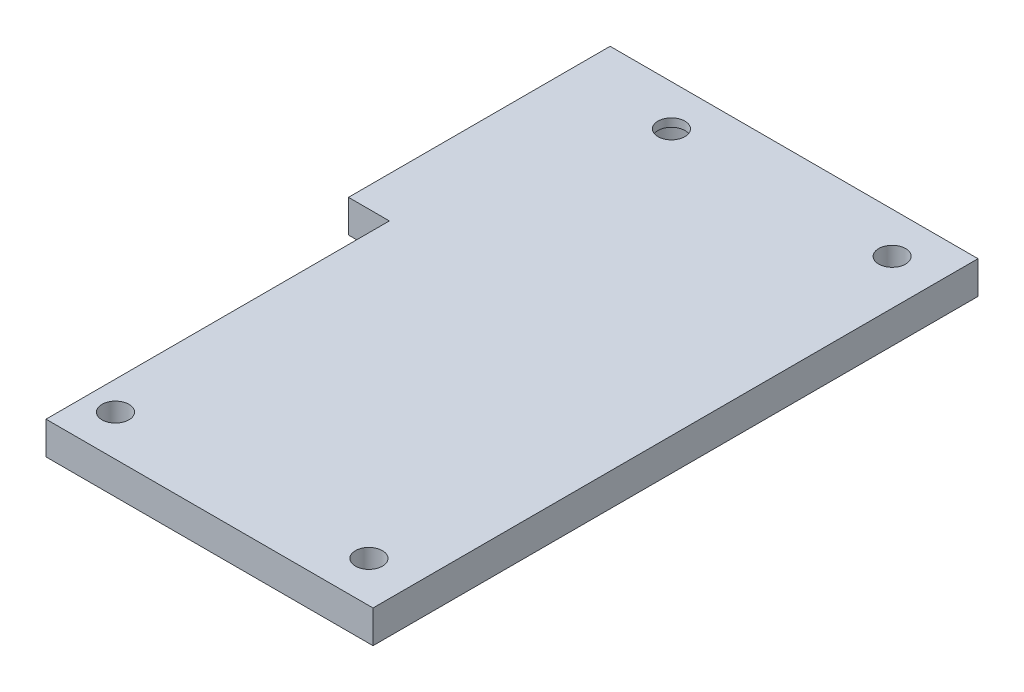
ISO-10303-21;
HEADER;
FILE_DESCRIPTION(('STEP AP214'),'2;1');
FILE_NAME('part.step','',(''),(''),'','','');
FILE_SCHEMA(('AUTOMOTIVE_DESIGN { 1 0 10303 214 1 1 1 1 }'));
ENDSEC;
DATA;
#1=APPLICATION_CONTEXT('core data for automotive mechanical design processes');
#2=APPLICATION_PROTOCOL_DEFINITION('international standard','automotive_design',2000,#1);
#3=PRODUCT_CONTEXT('',#1,'mechanical');
#4=PRODUCT('Part','Part','',(#3));
#5=PRODUCT_RELATED_PRODUCT_CATEGORY('part','',(#4));
#6=PRODUCT_DEFINITION_FORMATION('','',#4);
#7=PRODUCT_DEFINITION_CONTEXT('part definition',#1,'design');
#8=PRODUCT_DEFINITION('design','',#6,#7);
#9=PRODUCT_DEFINITION_SHAPE('','',#8);
#10=(LENGTH_UNIT() NAMED_UNIT(*) SI_UNIT(.MILLI.,.METRE.));
#11=(NAMED_UNIT(*) PLANE_ANGLE_UNIT() SI_UNIT($,.RADIAN.));
#12=(NAMED_UNIT(*) SI_UNIT($,.STERADIAN.) SOLID_ANGLE_UNIT());
#13=UNCERTAINTY_MEASURE_WITH_UNIT(LENGTH_MEASURE(1.E-05),#10,'distance_accuracy_value','');
#14=(GEOMETRIC_REPRESENTATION_CONTEXT(3) GLOBAL_UNCERTAINTY_ASSIGNED_CONTEXT((#13)) GLOBAL_UNIT_ASSIGNED_CONTEXT((#10,
#11,#12)) REPRESENTATION_CONTEXT('',''));
#15=CARTESIAN_POINT('',(0.,0.,0.));
#16=DIRECTION('',(0.,0.,1.));
#17=DIRECTION('',(1.,0.,0.));
#18=AXIS2_PLACEMENT_3D('',#15,#16,#17);
#19=CARTESIAN_POINT('',(-10.,4.,-32.));
#20=DIRECTION('',(0.,-1.,0.));
#21=DIRECTION('',(0.,0.,-1.));
#22=AXIS2_PLACEMENT_3D('',#19,#20,#21);
#23=CYLINDRICAL_SURFACE('',#22,1.65);
#24=CARTESIAN_POINT('',(-10.,4.,-32.));
#25=DIRECTION('',(0.,1.,0.));
#26=DIRECTION('',(0.,0.,1.));
#27=AXIS2_PLACEMENT_3D('',#24,#25,#26);
#28=CIRCLE('',#27,1.65);
#29=CARTESIAN_POINT('',(-10.,4.,-30.35));
#30=VERTEX_POINT('',#29);
#31=EDGE_CURVE('E123',#30,#30,#28,.T.);
#32=ORIENTED_EDGE('',*,*,#31,.T.);
#33=EDGE_LOOP('',(#32));
#34=FACE_BOUND('',#33,.T.);
#35=CARTESIAN_POINT('',(-10.,3.,-32.));
#36=DIRECTION('',(0.,-1.,0.));
#37=DIRECTION('',(0.,0.,-1.));
#38=AXIS2_PLACEMENT_3D('',#35,#36,#37);
#39=CIRCLE('',#38,1.65);
#40=CARTESIAN_POINT('',(-10.,3.,-33.65));
#41=VERTEX_POINT('',#40);
#42=EDGE_CURVE('E39',#41,#41,#39,.T.);
#43=ORIENTED_EDGE('',*,*,#42,.T.);
#44=EDGE_LOOP('',(#43));
#45=FACE_BOUND('',#44,.T.);
#46=ADVANCED_FACE('F35',(#34,#45),#23,.F.);
#47=CARTESIAN_POINT('',(0.,4.,0.));
#48=DIRECTION('',(0.,1.,0.));
#49=DIRECTION('',(0.,0.,1.));
#50=AXIS2_PLACEMENT_3D('',#47,#48,#49);
#51=PLANE('',#50);
#52=DIRECTION('',(0.,0.,1.));
#53=VECTOR('',#52,1.);
#54=CARTESIAN_POINT('',(-17.5,4.,37.));
#55=LINE('',#54,#53);
#56=CARTESIAN_POINT('',(-17.5,4.,-4.99999999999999));
#57=VERTEX_POINT('',#56);
#58=CARTESIAN_POINT('',(-17.5,4.,37.));
#59=VERTEX_POINT('',#58);
#60=EDGE_CURVE('E106',#57,#59,#55,.T.);
#61=ORIENTED_EDGE('',*,*,#60,.T.);
#62=DIRECTION('',(1.,0.,0.));
#63=VECTOR('',#62,1.);
#64=CARTESIAN_POINT('',(22.5,4.,37.));
#65=LINE('',#64,#63);
#66=CARTESIAN_POINT('',(22.5,4.,37.));
#67=VERTEX_POINT('',#66);
#68=EDGE_CURVE('E82',#59,#67,#65,.T.);
#69=ORIENTED_EDGE('',*,*,#68,.T.);
#70=DIRECTION('',(0.,0.,-1.));
#71=VECTOR('',#70,1.);
#72=CARTESIAN_POINT('',(22.5,4.,37.));
#73=LINE('',#72,#71);
#74=CARTESIAN_POINT('',(22.5,4.,-37.));
#75=VERTEX_POINT('',#74);
#76=EDGE_CURVE('E118',#67,#75,#73,.T.);
#77=ORIENTED_EDGE('',*,*,#76,.T.);
#78=DIRECTION('',(-1.,0.,0.));
#79=VECTOR('',#78,1.);
#80=CARTESIAN_POINT('',(22.5,4.,-37.));
#81=LINE('',#80,#79);
#82=CARTESIAN_POINT('',(-22.5,4.,-37.));
#83=VERTEX_POINT('',#82);
#84=EDGE_CURVE('E60',#75,#83,#81,.T.);
#85=ORIENTED_EDGE('',*,*,#84,.T.);
#86=DIRECTION('',(0.,0.,1.));
#87=VECTOR('',#86,1.);
#88=CARTESIAN_POINT('',(-22.5,4.,37.));
#89=LINE('',#88,#87);
#90=CARTESIAN_POINT('',(-22.5,4.,-4.99999999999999));
#91=VERTEX_POINT('',#90);
#92=EDGE_CURVE('E111',#83,#91,#89,.T.);
#93=ORIENTED_EDGE('',*,*,#92,.T.);
#94=DIRECTION('',(1.,0.,0.));
#95=VECTOR('',#94,1.);
#96=CARTESIAN_POINT('',(-17.5,4.,-4.99999999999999));
#97=LINE('',#96,#95);
#98=EDGE_CURVE('E98',#91,#57,#97,.T.);
#99=ORIENTED_EDGE('',*,*,#98,.T.);
#100=EDGE_LOOP('',(#61,#69,#77,#85,#93,#99));
#101=FACE_BOUND('',#100,.T.);
#102=CARTESIAN_POINT('',(-14.,4.,32.));
#103=DIRECTION('',(0.,1.,0.));
#104=DIRECTION('',(0.,0.,1.));
#105=AXIS2_PLACEMENT_3D('',#102,#103,#104);
#106=CIRCLE('',#105,1.65);
#107=CARTESIAN_POINT('',(-14.,4.,33.65));
#108=VERTEX_POINT('',#107);
#109=EDGE_CURVE('E164',#108,#108,#106,.T.);
#110=ORIENTED_EDGE('',*,*,#109,.F.);
#111=EDGE_LOOP('',(#110));
#112=FACE_BOUND('',#111,.T.);
#113=ORIENTED_EDGE('',*,*,#31,.F.);
#114=EDGE_LOOP('',(#113));
#115=FACE_BOUND('',#114,.T.);
#116=CARTESIAN_POINT('',(17.,4.,-32.));
#117=DIRECTION('',(0.,1.,0.));
#118=DIRECTION('',(0.,0.,1.));
#119=AXIS2_PLACEMENT_3D('',#116,#117,#118);
#120=CIRCLE('',#119,1.65);
#121=CARTESIAN_POINT('',(17.,4.,-30.35));
#122=VERTEX_POINT('',#121);
#123=EDGE_CURVE('E170',#122,#122,#120,.T.);
#124=ORIENTED_EDGE('',*,*,#123,.F.);
#125=EDGE_LOOP('',(#124));
#126=FACE_BOUND('',#125,.T.);
#127=CARTESIAN_POINT('',(17.,4.,32.));
#128=DIRECTION('',(0.,1.,0.));
#129=DIRECTION('',(0.,0.,1.));
#130=AXIS2_PLACEMENT_3D('',#127,#128,#129);
#131=CIRCLE('',#130,1.65);
#132=CARTESIAN_POINT('',(17.,4.,33.65));
#133=VERTEX_POINT('',#132);
#134=EDGE_CURVE('E157',#133,#133,#131,.T.);
#135=ORIENTED_EDGE('',*,*,#134,.F.);
#136=EDGE_LOOP('',(#135));
#137=FACE_BOUND('',#136,.T.);
#138=ADVANCED_FACE('F115',(#101,#112,#115,#126,#137),#51,.T.);
#139=CARTESIAN_POINT('',(0.,0.,0.));
#140=DIRECTION('',(0.,1.,0.));
#141=DIRECTION('',(0.,0.,1.));
#142=AXIS2_PLACEMENT_3D('',#139,#140,#141);
#143=PLANE('',#142);
#144=CARTESIAN_POINT('',(-10.,0.,-32.));
#145=DIRECTION('',(0.,-1.,0.));
#146=DIRECTION('',(0.,0.,-1.));
#147=AXIS2_PLACEMENT_3D('',#144,#145,#146);
#148=CIRCLE('',#147,3.75);
#149=CARTESIAN_POINT('',(-10.,0.,-35.75));
#150=VERTEX_POINT('',#149);
#151=EDGE_CURVE('E150',#150,#150,#148,.T.);
#152=ORIENTED_EDGE('',*,*,#151,.F.);
#153=EDGE_LOOP('',(#152));
#154=FACE_BOUND('',#153,.T.);
#155=DIRECTION('',(1.,0.,0.));
#156=VECTOR('',#155,1.);
#157=CARTESIAN_POINT('',(22.5,0.,37.));
#158=LINE('',#157,#156);
#159=CARTESIAN_POINT('',(-17.5,0.,37.));
#160=VERTEX_POINT('',#159);
#161=CARTESIAN_POINT('',(22.5,0.,37.));
#162=VERTEX_POINT('',#161);
#163=EDGE_CURVE('E130',#160,#162,#158,.T.);
#164=ORIENTED_EDGE('',*,*,#163,.F.);
#165=DIRECTION('',(0.,0.,1.));
#166=VECTOR('',#165,1.);
#167=CARTESIAN_POINT('',(-17.5,0.,37.));
#168=LINE('',#167,#166);
#169=CARTESIAN_POINT('',(-17.5,0.,-4.99999999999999));
#170=VERTEX_POINT('',#169);
#171=EDGE_CURVE('E51',#170,#160,#168,.T.);
#172=ORIENTED_EDGE('',*,*,#171,.F.);
#173=DIRECTION('',(1.,0.,0.));
#174=VECTOR('',#173,1.);
#175=CARTESIAN_POINT('',(-17.5,0.,-4.99999999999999));
#176=LINE('',#175,#174);
#177=CARTESIAN_POINT('',(-22.5,0.,-4.99999999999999));
#178=VERTEX_POINT('',#177);
#179=EDGE_CURVE('E143',#178,#170,#176,.T.);
#180=ORIENTED_EDGE('',*,*,#179,.F.);
#181=DIRECTION('',(0.,0.,1.));
#182=VECTOR('',#181,1.);
#183=CARTESIAN_POINT('',(-22.5,0.,37.));
#184=LINE('',#183,#182);
#185=CARTESIAN_POINT('',(-22.5,0.,-37.));
#186=VERTEX_POINT('',#185);
#187=EDGE_CURVE('E113',#186,#178,#184,.T.);
#188=ORIENTED_EDGE('',*,*,#187,.F.);
#189=DIRECTION('',(-1.,0.,0.));
#190=VECTOR('',#189,1.);
#191=CARTESIAN_POINT('',(22.5,0.,-37.));
#192=LINE('',#191,#190);
#193=CARTESIAN_POINT('',(22.5,0.,-37.));
#194=VERTEX_POINT('',#193);
#195=EDGE_CURVE('E77',#194,#186,#192,.T.);
#196=ORIENTED_EDGE('',*,*,#195,.F.);
#197=DIRECTION('',(0.,0.,-1.));
#198=VECTOR('',#197,1.);
#199=CARTESIAN_POINT('',(22.5,0.,37.));
#200=LINE('',#199,#198);
#201=EDGE_CURVE('E120',#162,#194,#200,.T.);
#202=ORIENTED_EDGE('',*,*,#201,.F.);
#203=EDGE_LOOP('',(#164,#172,#180,#188,#196,#202));
#204=FACE_BOUND('',#203,.T.);
#205=CARTESIAN_POINT('',(17.,0.,-32.));
#206=DIRECTION('',(0.,1.,0.));
#207=DIRECTION('',(0.,0.,1.));
#208=AXIS2_PLACEMENT_3D('',#205,#206,#207);
#209=CIRCLE('',#208,1.65);
#210=CARTESIAN_POINT('',(17.,0.,-30.35));
#211=VERTEX_POINT('',#210);
#212=EDGE_CURVE('E167',#211,#211,#209,.T.);
#213=ORIENTED_EDGE('',*,*,#212,.T.);
#214=EDGE_LOOP('',(#213));
#215=FACE_BOUND('',#214,.T.);
#216=CARTESIAN_POINT('',(-14.,0.,32.));
#217=DIRECTION('',(0.,1.,0.));
#218=DIRECTION('',(0.,0.,1.));
#219=AXIS2_PLACEMENT_3D('',#216,#217,#218);
#220=CIRCLE('',#219,1.65);
#221=CARTESIAN_POINT('',(-14.,0.,33.65));
#222=VERTEX_POINT('',#221);
#223=EDGE_CURVE('E160',#222,#222,#220,.T.);
#224=ORIENTED_EDGE('',*,*,#223,.T.);
#225=EDGE_LOOP('',(#224));
#226=FACE_BOUND('',#225,.T.);
#227=CARTESIAN_POINT('',(17.,0.,32.));
#228=DIRECTION('',(0.,1.,0.));
#229=DIRECTION('',(0.,0.,1.));
#230=AXIS2_PLACEMENT_3D('',#227,#228,#229);
#231=CIRCLE('',#230,1.65);
#232=CARTESIAN_POINT('',(17.,0.,33.65));
#233=VERTEX_POINT('',#232);
#234=EDGE_CURVE('E161',#233,#233,#231,.T.);
#235=ORIENTED_EDGE('',*,*,#234,.T.);
#236=EDGE_LOOP('',(#235));
#237=FACE_BOUND('',#236,.T.);
#238=ADVANCED_FACE('F141',(#154,#204,#215,#226,#237),#143,.F.);
#239=CARTESIAN_POINT('',(-22.5,4.,37.));
#240=DIRECTION('',(1.,0.,0.));
#241=DIRECTION('',(0.,0.,-1.));
#242=AXIS2_PLACEMENT_3D('',#239,#240,#241);
#243=PLANE('',#242);
#244=ORIENTED_EDGE('',*,*,#187,.T.);
#245=DIRECTION('',(0.,-1.,0.));
#246=VECTOR('',#245,1.);
#247=CARTESIAN_POINT('',(-22.5,4.,-4.99999999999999));
#248=LINE('',#247,#246);
#249=EDGE_CURVE('E102',#91,#178,#248,.T.);
#250=ORIENTED_EDGE('',*,*,#249,.F.);
#251=ORIENTED_EDGE('',*,*,#92,.F.);
#252=DIRECTION('',(0.,-1.,0.));
#253=VECTOR('',#252,1.);
#254=CARTESIAN_POINT('',(-22.5,4.,-37.));
#255=LINE('',#254,#253);
#256=EDGE_CURVE('E128',#83,#186,#255,.T.);
#257=ORIENTED_EDGE('',*,*,#256,.T.);
#258=EDGE_LOOP('',(#244,#250,#251,#257));
#259=FACE_BOUND('',#258,.T.);
#260=ADVANCED_FACE('F37',(#259),#243,.F.);
#261=CARTESIAN_POINT('',(22.5,4.,37.));
#262=DIRECTION('',(0.,0.,-1.));
#263=DIRECTION('',(-1.,0.,0.));
#264=AXIS2_PLACEMENT_3D('',#261,#262,#263);
#265=PLANE('',#264);
#266=ORIENTED_EDGE('',*,*,#68,.F.);
#267=DIRECTION('',(0.,-1.,0.));
#268=VECTOR('',#267,1.);
#269=CARTESIAN_POINT('',(-17.5,4.,37.));
#270=LINE('',#269,#268);
#271=EDGE_CURVE('E148',#59,#160,#270,.T.);
#272=ORIENTED_EDGE('',*,*,#271,.T.);
#273=ORIENTED_EDGE('',*,*,#163,.T.);
#274=DIRECTION('',(0.,-1.,0.));
#275=VECTOR('',#274,1.);
#276=CARTESIAN_POINT('',(22.5,4.,37.));
#277=LINE('',#276,#275);
#278=EDGE_CURVE('E11',#67,#162,#277,.T.);
#279=ORIENTED_EDGE('',*,*,#278,.F.);
#280=EDGE_LOOP('',(#266,#272,#273,#279));
#281=FACE_BOUND('',#280,.T.);
#282=ADVANCED_FACE('F204',(#281),#265,.F.);
#283=CARTESIAN_POINT('',(22.5,4.,37.));
#284=DIRECTION('',(-1.,0.,0.));
#285=DIRECTION('',(0.,0.,1.));
#286=AXIS2_PLACEMENT_3D('',#283,#284,#285);
#287=PLANE('',#286);
#288=ORIENTED_EDGE('',*,*,#201,.T.);
#289=DIRECTION('',(0.,-1.,0.));
#290=VECTOR('',#289,1.);
#291=CARTESIAN_POINT('',(22.5,4.,-37.));
#292=LINE('',#291,#290);
#293=EDGE_CURVE('E44',#75,#194,#292,.T.);
#294=ORIENTED_EDGE('',*,*,#293,.F.);
#295=ORIENTED_EDGE('',*,*,#76,.F.);
#296=ORIENTED_EDGE('',*,*,#278,.T.);
#297=EDGE_LOOP('',(#288,#294,#295,#296));
#298=FACE_BOUND('',#297,.T.);
#299=ADVANCED_FACE('F188',(#298),#287,.F.);
#300=CARTESIAN_POINT('',(22.5,4.,-37.));
#301=DIRECTION('',(0.,0.,1.));
#302=DIRECTION('',(1.,0.,0.));
#303=AXIS2_PLACEMENT_3D('',#300,#301,#302);
#304=PLANE('',#303);
#305=ORIENTED_EDGE('',*,*,#195,.T.);
#306=ORIENTED_EDGE('',*,*,#256,.F.);
#307=ORIENTED_EDGE('',*,*,#84,.F.);
#308=ORIENTED_EDGE('',*,*,#293,.T.);
#309=EDGE_LOOP('',(#305,#306,#307,#308));
#310=FACE_BOUND('',#309,.T.);
#311=ADVANCED_FACE('F135',(#310),#304,.F.);
#312=CARTESIAN_POINT('',(17.,4.,-32.));
#313=DIRECTION('',(0.,-1.,0.));
#314=DIRECTION('',(0.,0.,-1.));
#315=AXIS2_PLACEMENT_3D('',#312,#313,#314);
#316=CYLINDRICAL_SURFACE('',#315,1.65);
#317=ORIENTED_EDGE('',*,*,#123,.T.);
#318=EDGE_LOOP('',(#317));
#319=FACE_BOUND('',#318,.T.);
#320=ORIENTED_EDGE('',*,*,#212,.F.);
#321=EDGE_LOOP('',(#320));
#322=FACE_BOUND('',#321,.T.);
#323=ADVANCED_FACE('F176',(#319,#322),#316,.F.);
#324=CARTESIAN_POINT('',(-14.,4.,32.));
#325=DIRECTION('',(0.,-1.,0.));
#326=DIRECTION('',(0.,0.,-1.));
#327=AXIS2_PLACEMENT_3D('',#324,#325,#326);
#328=CYLINDRICAL_SURFACE('',#327,1.65);
#329=ORIENTED_EDGE('',*,*,#109,.T.);
#330=EDGE_LOOP('',(#329));
#331=FACE_BOUND('',#330,.T.);
#332=ORIENTED_EDGE('',*,*,#223,.F.);
#333=EDGE_LOOP('',(#332));
#334=FACE_BOUND('',#333,.T.);
#335=ADVANCED_FACE('F178',(#331,#334),#328,.F.);
#336=CARTESIAN_POINT('',(17.,4.,32.));
#337=DIRECTION('',(0.,-1.,0.));
#338=DIRECTION('',(0.,0.,-1.));
#339=AXIS2_PLACEMENT_3D('',#336,#337,#338);
#340=CYLINDRICAL_SURFACE('',#339,1.65);
#341=ORIENTED_EDGE('',*,*,#134,.T.);
#342=EDGE_LOOP('',(#341));
#343=FACE_BOUND('',#342,.T.);
#344=ORIENTED_EDGE('',*,*,#234,.F.);
#345=EDGE_LOOP('',(#344));
#346=FACE_BOUND('',#345,.T.);
#347=ADVANCED_FACE('F185',(#343,#346),#340,.F.);
#348=CARTESIAN_POINT('',(-10.,3.,-32.));
#349=DIRECTION('',(0.,-1.,0.));
#350=DIRECTION('',(0.,0.,-1.));
#351=AXIS2_PLACEMENT_3D('',#348,#349,#350);
#352=CYLINDRICAL_SURFACE('',#351,3.75);
#353=CARTESIAN_POINT('',(-10.,3.,-32.));
#354=DIRECTION('',(0.,-1.,0.));
#355=DIRECTION('',(0.,0.,-1.));
#356=AXIS2_PLACEMENT_3D('',#353,#354,#355);
#357=CIRCLE('',#356,3.75);
#358=CARTESIAN_POINT('',(-10.,3.,-35.75));
#359=VERTEX_POINT('',#358);
#360=EDGE_CURVE('E152',#359,#359,#357,.T.);
#361=ORIENTED_EDGE('',*,*,#360,.F.);
#362=EDGE_LOOP('',(#361));
#363=FACE_BOUND('',#362,.T.);
#364=ORIENTED_EDGE('',*,*,#151,.T.);
#365=EDGE_LOOP('',(#364));
#366=FACE_BOUND('',#365,.T.);
#367=ADVANCED_FACE('F219',(#363,#366),#352,.F.);
#368=CARTESIAN_POINT('',(-10.,3.,-32.));
#369=DIRECTION('',(0.,-1.,0.));
#370=DIRECTION('',(0.,0.,-1.));
#371=AXIS2_PLACEMENT_3D('',#368,#369,#370);
#372=PLANE('',#371);
#373=ORIENTED_EDGE('',*,*,#42,.F.);
#374=EDGE_LOOP('',(#373));
#375=FACE_BOUND('',#374,.T.);
#376=ORIENTED_EDGE('',*,*,#360,.T.);
#377=EDGE_LOOP('',(#376));
#378=FACE_BOUND('',#377,.T.);
#379=ADVANCED_FACE('F212',(#375,#378),#372,.T.);
#380=CARTESIAN_POINT('',(-17.5,4.,37.));
#381=DIRECTION('',(1.,0.,0.));
#382=DIRECTION('',(0.,0.,-1.));
#383=AXIS2_PLACEMENT_3D('',#380,#381,#382);
#384=PLANE('',#383);
#385=ORIENTED_EDGE('',*,*,#171,.T.);
#386=ORIENTED_EDGE('',*,*,#271,.F.);
#387=ORIENTED_EDGE('',*,*,#60,.F.);
#388=DIRECTION('',(0.,-1.,0.));
#389=VECTOR('',#388,1.);
#390=CARTESIAN_POINT('',(-17.5,4.,-4.99999999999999));
#391=LINE('',#390,#389);
#392=EDGE_CURVE('E104',#57,#170,#391,.T.);
#393=ORIENTED_EDGE('',*,*,#392,.T.);
#394=EDGE_LOOP('',(#385,#386,#387,#393));
#395=FACE_BOUND('',#394,.T.);
#396=ADVANCED_FACE('F210',(#395),#384,.F.);
#397=CARTESIAN_POINT('',(-17.5,4.,-4.99999999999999));
#398=DIRECTION('',(0.,0.,-1.));
#399=DIRECTION('',(-1.,0.,0.));
#400=AXIS2_PLACEMENT_3D('',#397,#398,#399);
#401=PLANE('',#400);
#402=ORIENTED_EDGE('',*,*,#179,.T.);
#403=ORIENTED_EDGE('',*,*,#392,.F.);
#404=ORIENTED_EDGE('',*,*,#98,.F.);
#405=ORIENTED_EDGE('',*,*,#249,.T.);
#406=EDGE_LOOP('',(#402,#403,#404,#405));
#407=FACE_BOUND('',#406,.T.);
#408=ADVANCED_FACE('F101',(#407),#401,.F.);
#409=CLOSED_SHELL('',(#46,#138,#238,#260,#282,#299,#311,#323,#335,#347,#367,#379,#396,#408));
#410=MANIFOLD_SOLID_BREP('B2',#409);
#411=ADVANCED_BREP_SHAPE_REPRESENTATION('',(#18,#410),#14);
#412=SHAPE_DEFINITION_REPRESENTATION(#9,#411);
ENDSEC;
END-ISO-10303-21;
